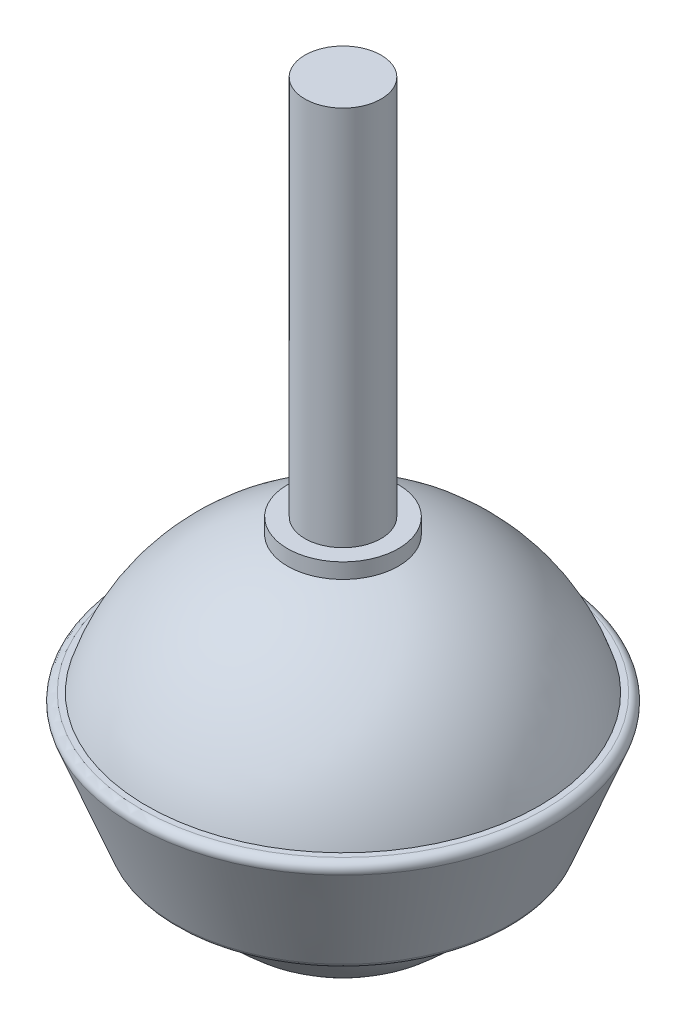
from build123d import *


with BuildPart() as part:
    # Esquisse1 → R_volution1 (revolve)
    with BuildSketch(Plane.XY, mode=Mode.PRIVATE) as r_volution1_sk:
        with BuildLine():
            Line((0, 0), (5, 0))
            Line((5, 0), (5, -50))
            Line((5, -50), (7.280109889, -50))
            Line((7.280109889, -50), (7.280109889, -52))
            ThreePointArc((7.280109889, -52), (18.824671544, -58.644594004), (25.787593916, -70))
            Line((25.787593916, -70), (26.535827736, -70))
            ThreePointArc((26.535827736, -70), (27.361608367, -70.436008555), (27.467294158, -71.3638273))
            Line((27.467294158, -71.3638273), (21.99894653, -85.3638273))
            ThreePointArc((21.99894653, -85.3638273), (21.631471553, -85.825780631), (21.067480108, -86))
            Line((21.067480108, -86), (18.33030278, -86))
            ThreePointArc((18.33030278, -86), (10.95445115, -94.733200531), (0, -98))
            Line((0, -98), (0, 0))
        make_face()
    revolve(r_volution1_sk.sketch.rotate(Axis((0, 0, 0), (0, -1, 0)), 180), axis=Axis((0, 0, 0), (0, -1, 0)))


solid = part.part
